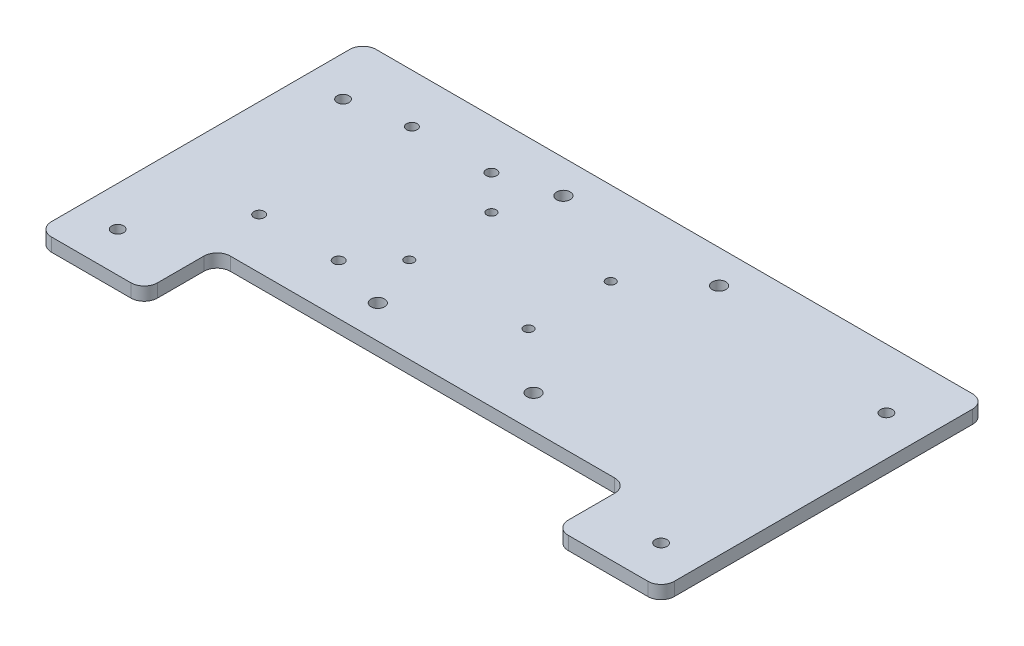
ISO-10303-21;
HEADER;
FILE_DESCRIPTION(('STEP AP214'),'2;1');
FILE_NAME('part.step','',(''),(''),'','','');
FILE_SCHEMA(('AUTOMOTIVE_DESIGN { 1 0 10303 214 1 1 1 1 }'));
ENDSEC;
DATA;
#1=APPLICATION_CONTEXT('core data for automotive mechanical design processes');
#2=APPLICATION_PROTOCOL_DEFINITION('international standard','automotive_design',2000,#1);
#3=PRODUCT_CONTEXT('',#1,'mechanical');
#4=PRODUCT('Part','Part','',(#3));
#5=PRODUCT_RELATED_PRODUCT_CATEGORY('part','',(#4));
#6=PRODUCT_DEFINITION_FORMATION('','',#4);
#7=PRODUCT_DEFINITION_CONTEXT('part definition',#1,'design');
#8=PRODUCT_DEFINITION('design','',#6,#7);
#9=PRODUCT_DEFINITION_SHAPE('','',#8);
#10=(LENGTH_UNIT() NAMED_UNIT(*) SI_UNIT(.MILLI.,.METRE.));
#11=(NAMED_UNIT(*) PLANE_ANGLE_UNIT() SI_UNIT($,.RADIAN.));
#12=(NAMED_UNIT(*) SI_UNIT($,.STERADIAN.) SOLID_ANGLE_UNIT());
#13=UNCERTAINTY_MEASURE_WITH_UNIT(LENGTH_MEASURE(1.E-05),#10,'distance_accuracy_value','');
#14=(GEOMETRIC_REPRESENTATION_CONTEXT(3) GLOBAL_UNCERTAINTY_ASSIGNED_CONTEXT((#13)) GLOBAL_UNIT_ASSIGNED_CONTEXT((#10,
#11,#12)) REPRESENTATION_CONTEXT('',''));
#15=CARTESIAN_POINT('',(0.,0.,0.));
#16=DIRECTION('',(0.,0.,1.));
#17=DIRECTION('',(1.,0.,0.));
#18=AXIS2_PLACEMENT_3D('',#15,#16,#17);
#19=CARTESIAN_POINT('',(145.,10.,-45.));
#20=DIRECTION('',(0.,1.,0.));
#21=DIRECTION('',(0.,0.,1.));
#22=AXIS2_PLACEMENT_3D('',#19,#20,#21);
#23=PLANE('',#22);
#24=CARTESIAN_POINT('',(-161.05,10.,-208.));
#25=DIRECTION('',(0.,1.,0.));
#26=DIRECTION('',(0.,0.,1.));
#27=AXIS2_PLACEMENT_3D('',#24,#25,#26);
#28=CIRCLE('',#27,3.99999999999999);
#29=CARTESIAN_POINT('',(-161.05,10.,-204.));
#30=VERTEX_POINT('',#29);
#31=EDGE_CURVE('E411',#30,#30,#28,.T.);
#32=ORIENTED_EDGE('',*,*,#31,.F.);
#33=EDGE_LOOP('',(#32));
#34=FACE_BOUND('',#33,.T.);
#35=CARTESIAN_POINT('',(-161.27839267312,10.,-93.0002267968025));
#36=DIRECTION('',(0.,1.,0.));
#37=DIRECTION('',(0.,0.,1.));
#38=AXIS2_PLACEMENT_3D('',#35,#36,#37);
#39=CIRCLE('',#38,3.99999999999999);
#40=CARTESIAN_POINT('',(-161.27839267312,10.,-89.0002267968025));
#41=VERTEX_POINT('',#40);
#42=EDGE_CURVE('E415',#41,#41,#39,.T.);
#43=ORIENTED_EDGE('',*,*,#42,.F.);
#44=EDGE_LOOP('',(#43));
#45=FACE_BOUND('',#44,.T.);
#46=CARTESIAN_POINT('',(-101.27839267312,10.,-93.0002267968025));
#47=DIRECTION('',(0.,1.,0.));
#48=DIRECTION('',(0.,0.,1.));
#49=AXIS2_PLACEMENT_3D('',#46,#47,#48);
#50=CIRCLE('',#49,4.00000000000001);
#51=CARTESIAN_POINT('',(-101.27839267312,10.,-89.0002267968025));
#52=VERTEX_POINT('',#51);
#53=EDGE_CURVE('E424',#52,#52,#50,.T.);
#54=ORIENTED_EDGE('',*,*,#53,.F.);
#55=EDGE_LOOP('',(#54));
#56=FACE_BOUND('',#55,.T.);
#57=CARTESIAN_POINT('',(-101.05,10.,-208.));
#58=DIRECTION('',(0.,1.,0.));
#59=DIRECTION('',(0.,0.,1.));
#60=AXIS2_PLACEMENT_3D('',#57,#58,#59);
#61=CIRCLE('',#60,4.00000000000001);
#62=CARTESIAN_POINT('',(-101.05,10.,-204.));
#63=VERTEX_POINT('',#62);
#64=EDGE_CURVE('E430',#63,#63,#61,.T.);
#65=ORIENTED_EDGE('',*,*,#64,.F.);
#66=EDGE_LOOP('',(#65));
#67=FACE_BOUND('',#66,.T.);
#68=CARTESIAN_POINT('',(58.75,10.,-220.));
#69=DIRECTION('',(0.,1.,0.));
#70=DIRECTION('',(0.,0.,1.));
#71=AXIS2_PLACEMENT_3D('',#68,#69,#70);
#72=CIRCLE('',#71,5.12500000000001);
#73=CARTESIAN_POINT('',(58.75,10.,-214.875));
#74=VERTEX_POINT('',#73);
#75=EDGE_CURVE('E436',#74,#74,#72,.T.);
#76=ORIENTED_EDGE('',*,*,#75,.F.);
#77=EDGE_LOOP('',(#76));
#78=FACE_BOUND('',#77,.T.);
#79=CARTESIAN_POINT('',(-58.75,10.,-220.));
#80=DIRECTION('',(0.,1.,0.));
#81=DIRECTION('',(0.,0.,1.));
#82=AXIS2_PLACEMENT_3D('',#79,#80,#81);
#83=CIRCLE('',#82,5.12500000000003);
#84=CARTESIAN_POINT('',(-58.75,10.,-214.875));
#85=VERTEX_POINT('',#84);
#86=EDGE_CURVE('E442',#85,#85,#83,.T.);
#87=ORIENTED_EDGE('',*,*,#86,.F.);
#88=EDGE_LOOP('',(#87));
#89=FACE_BOUND('',#88,.T.);
#90=CARTESIAN_POINT('',(58.75,10.,-80.));
#91=DIRECTION('',(0.,1.,0.));
#92=DIRECTION('',(0.,0.,1.));
#93=AXIS2_PLACEMENT_3D('',#90,#91,#92);
#94=CIRCLE('',#93,5.12500000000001);
#95=CARTESIAN_POINT('',(58.75,10.,-74.875));
#96=VERTEX_POINT('',#95);
#97=EDGE_CURVE('E448',#96,#96,#94,.T.);
#98=ORIENTED_EDGE('',*,*,#97,.F.);
#99=EDGE_LOOP('',(#98));
#100=FACE_BOUND('',#99,.T.);
#101=CARTESIAN_POINT('',(-58.75,10.,-80.));
#102=DIRECTION('',(0.,1.,0.));
#103=DIRECTION('',(0.,0.,1.));
#104=AXIS2_PLACEMENT_3D('',#101,#102,#103);
#105=CIRCLE('',#104,5.125);
#106=CARTESIAN_POINT('',(-58.75,10.,-74.875));
#107=VERTEX_POINT('',#106);
#108=EDGE_CURVE('E454',#107,#107,#105,.T.);
#109=ORIENTED_EDGE('',*,*,#108,.F.);
#110=EDGE_LOOP('',(#109));
#111=FACE_BOUND('',#110,.T.);
#112=CARTESIAN_POINT('',(15.,10.,-182.));
#113=DIRECTION('',(0.,1.,0.));
#114=DIRECTION('',(0.,0.,1.));
#115=AXIS2_PLACEMENT_3D('',#112,#113,#114);
#116=CIRCLE('',#115,3.5);
#117=CARTESIAN_POINT('',(15.,10.,-178.5));
#118=VERTEX_POINT('',#117);
#119=EDGE_CURVE('E469',#118,#118,#116,.T.);
#120=ORIENTED_EDGE('',*,*,#119,.F.);
#121=EDGE_LOOP('',(#120));
#122=FACE_BOUND('',#121,.T.);
#123=CARTESIAN_POINT('',(-75.,10.,-182.));
#124=DIRECTION('',(0.,1.,0.));
#125=DIRECTION('',(0.,0.,1.));
#126=AXIS2_PLACEMENT_3D('',#123,#124,#125);
#127=CIRCLE('',#126,3.50000000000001);
#128=CARTESIAN_POINT('',(-75.,10.,-178.5));
#129=VERTEX_POINT('',#128);
#130=EDGE_CURVE('E481',#129,#129,#127,.T.);
#131=ORIENTED_EDGE('',*,*,#130,.F.);
#132=EDGE_LOOP('',(#131));
#133=FACE_BOUND('',#132,.T.);
#134=CARTESIAN_POINT('',(-205.,10.,-30.));
#135=DIRECTION('',(0.,1.,0.));
#136=DIRECTION('',(0.,0.,-1.));
#137=AXIS2_PLACEMENT_3D('',#134,#135,#136);
#138=CIRCLE('',#137,4.49999999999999);
#139=CARTESIAN_POINT('',(-205.,10.,-34.5));
#140=VERTEX_POINT('',#139);
#141=EDGE_CURVE('E493',#140,#140,#138,.T.);
#142=ORIENTED_EDGE('',*,*,#141,.F.);
#143=EDGE_LOOP('',(#142));
#144=FACE_BOUND('',#143,.T.);
#145=CARTESIAN_POINT('',(205.,10.,-200.));
#146=DIRECTION('',(0.,1.,0.));
#147=DIRECTION('',(0.,0.,1.));
#148=AXIS2_PLACEMENT_3D('',#145,#146,#147);
#149=CIRCLE('',#148,4.49999999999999);
#150=CARTESIAN_POINT('',(205.,10.,-195.5));
#151=VERTEX_POINT('',#150);
#152=EDGE_CURVE('E161',#151,#151,#149,.T.);
#153=ORIENTED_EDGE('',*,*,#152,.F.);
#154=EDGE_LOOP('',(#153));
#155=FACE_BOUND('',#154,.T.);
#156=CARTESIAN_POINT('',(145.,10.,-45.));
#157=DIRECTION('',(0.,-1.,0.));
#158=DIRECTION('',(0.,0.,1.));
#159=AXIS2_PLACEMENT_3D('',#156,#157,#158);
#160=CIRCLE('',#159,10.);
#161=CARTESIAN_POINT('',(145.,10.,-55.));
#162=VERTEX_POINT('',#161);
#163=CARTESIAN_POINT('',(155.,10.,-44.9999999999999));
#164=VERTEX_POINT('',#163);
#165=EDGE_CURVE('E195',#162,#164,#160,.T.);
#166=ORIENTED_EDGE('',*,*,#165,.T.);
#167=DIRECTION('',(0.,0.,1.));
#168=VECTOR('',#167,1.);
#169=CARTESIAN_POINT('',(155.,10.,-44.9999999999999));
#170=LINE('',#169,#168);
#171=CARTESIAN_POINT('',(155.,10.,-10.0000000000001));
#172=VERTEX_POINT('',#171);
#173=EDGE_CURVE('E156',#164,#172,#170,.T.);
#174=ORIENTED_EDGE('',*,*,#173,.T.);
#175=CARTESIAN_POINT('',(165.,10.,-10.));
#176=DIRECTION('',(0.,1.,0.));
#177=DIRECTION('',(0.,0.,-1.));
#178=AXIS2_PLACEMENT_3D('',#175,#176,#177);
#179=CIRCLE('',#178,10.);
#180=CARTESIAN_POINT('',(165.,10.,0.));
#181=VERTEX_POINT('',#180);
#182=EDGE_CURVE('E198',#172,#181,#179,.T.);
#183=ORIENTED_EDGE('',*,*,#182,.T.);
#184=DIRECTION('',(1.,0.,0.));
#185=VECTOR('',#184,1.);
#186=CARTESIAN_POINT('',(165.,10.,0.));
#187=LINE('',#186,#185);
#188=CARTESIAN_POINT('',(225.,10.,0.));
#189=VERTEX_POINT('',#188);
#190=EDGE_CURVE('E200',#181,#189,#187,.T.);
#191=ORIENTED_EDGE('',*,*,#190,.T.);
#192=CARTESIAN_POINT('',(225.,10.,-10.));
#193=DIRECTION('',(0.,1.,0.));
#194=DIRECTION('',(0.,0.,-1.));
#195=AXIS2_PLACEMENT_3D('',#192,#193,#194);
#196=CIRCLE('',#195,10.);
#197=CARTESIAN_POINT('',(235.,10.,-10.0000000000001));
#198=VERTEX_POINT('',#197);
#199=EDGE_CURVE('E202',#189,#198,#196,.T.);
#200=ORIENTED_EDGE('',*,*,#199,.T.);
#201=DIRECTION('',(0.,0.,-1.));
#202=VECTOR('',#201,1.);
#203=CARTESIAN_POINT('',(235.,10.,-10.0000000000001));
#204=LINE('',#203,#202);
#205=CARTESIAN_POINT('',(235.,10.,-235.));
#206=VERTEX_POINT('',#205);
#207=EDGE_CURVE('E204',#198,#206,#204,.T.);
#208=ORIENTED_EDGE('',*,*,#207,.T.);
#209=CARTESIAN_POINT('',(225.,10.,-235.));
#210=DIRECTION('',(0.,1.,0.));
#211=DIRECTION('',(0.,0.,-1.));
#212=AXIS2_PLACEMENT_3D('',#209,#210,#211);
#213=CIRCLE('',#212,10.);
#214=CARTESIAN_POINT('',(225.,10.,-245.));
#215=VERTEX_POINT('',#214);
#216=EDGE_CURVE('E206',#206,#215,#213,.T.);
#217=ORIENTED_EDGE('',*,*,#216,.T.);
#218=DIRECTION('',(-1.,0.,0.));
#219=VECTOR('',#218,1.);
#220=CARTESIAN_POINT('',(-225.,10.,-245.));
#221=LINE('',#220,#219);
#222=CARTESIAN_POINT('',(-225.,10.,-245.));
#223=VERTEX_POINT('',#222);
#224=EDGE_CURVE('E208',#215,#223,#221,.T.);
#225=ORIENTED_EDGE('',*,*,#224,.T.);
#226=CARTESIAN_POINT('',(-225.,10.,-235.));
#227=DIRECTION('',(0.,1.,0.));
#228=DIRECTION('',(0.,0.,1.));
#229=AXIS2_PLACEMENT_3D('',#226,#227,#228);
#230=CIRCLE('',#229,10.);
#231=CARTESIAN_POINT('',(-235.,10.,-235.));
#232=VERTEX_POINT('',#231);
#233=EDGE_CURVE('E210',#223,#232,#230,.T.);
#234=ORIENTED_EDGE('',*,*,#233,.T.);
#235=DIRECTION('',(0.,0.,1.));
#236=VECTOR('',#235,1.);
#237=CARTESIAN_POINT('',(-235.,10.,-10.0000000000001));
#238=LINE('',#237,#236);
#239=CARTESIAN_POINT('',(-235.,10.,-10.0000000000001));
#240=VERTEX_POINT('',#239);
#241=EDGE_CURVE('E212',#232,#240,#238,.T.);
#242=ORIENTED_EDGE('',*,*,#241,.T.);
#243=CARTESIAN_POINT('',(-225.,10.,-10.));
#244=DIRECTION('',(0.,1.,0.));
#245=DIRECTION('',(0.,0.,1.));
#246=AXIS2_PLACEMENT_3D('',#243,#244,#245);
#247=CIRCLE('',#246,10.);
#248=CARTESIAN_POINT('',(-225.,10.,0.));
#249=VERTEX_POINT('',#248);
#250=EDGE_CURVE('E214',#240,#249,#247,.T.);
#251=ORIENTED_EDGE('',*,*,#250,.T.);
#252=DIRECTION('',(1.,0.,0.));
#253=VECTOR('',#252,1.);
#254=CARTESIAN_POINT('',(-165.,10.,0.));
#255=LINE('',#254,#253);
#256=CARTESIAN_POINT('',(-165.,10.,0.));
#257=VERTEX_POINT('',#256);
#258=EDGE_CURVE('E216',#249,#257,#255,.T.);
#259=ORIENTED_EDGE('',*,*,#258,.T.);
#260=CARTESIAN_POINT('',(-165.,10.,-10.));
#261=DIRECTION('',(0.,1.,0.));
#262=DIRECTION('',(0.,0.,1.));
#263=AXIS2_PLACEMENT_3D('',#260,#261,#262);
#264=CIRCLE('',#263,10.);
#265=CARTESIAN_POINT('',(-155.,10.,-10.0000000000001));
#266=VERTEX_POINT('',#265);
#267=EDGE_CURVE('E218',#257,#266,#264,.T.);
#268=ORIENTED_EDGE('',*,*,#267,.T.);
#269=DIRECTION('',(0.,0.,-1.));
#270=VECTOR('',#269,1.);
#271=CARTESIAN_POINT('',(-155.,10.,-44.9999999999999));
#272=LINE('',#271,#270);
#273=CARTESIAN_POINT('',(-155.,10.,-44.9999999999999));
#274=VERTEX_POINT('',#273);
#275=EDGE_CURVE('E220',#266,#274,#272,.T.);
#276=ORIENTED_EDGE('',*,*,#275,.T.);
#277=CARTESIAN_POINT('',(-145.,10.,-45.));
#278=DIRECTION('',(0.,-1.,0.));
#279=DIRECTION('',(0.,0.,-1.));
#280=AXIS2_PLACEMENT_3D('',#277,#278,#279);
#281=CIRCLE('',#280,10.);
#282=CARTESIAN_POINT('',(-145.,10.,-55.));
#283=VERTEX_POINT('',#282);
#284=EDGE_CURVE('E49',#274,#283,#281,.T.);
#285=ORIENTED_EDGE('',*,*,#284,.T.);
#286=DIRECTION('',(1.,0.,0.));
#287=VECTOR('',#286,1.);
#288=CARTESIAN_POINT('',(-145.,10.,-55.));
#289=LINE('',#288,#287);
#290=EDGE_CURVE('E44',#283,#162,#289,.T.);
#291=ORIENTED_EDGE('',*,*,#290,.T.);
#292=EDGE_LOOP('',(#166,#174,#183,#191,#200,#208,#217,#225,#234,#242,#251,#259,#268,#276,#285,#291));
#293=FACE_BOUND('',#292,.T.);
#294=CARTESIAN_POINT('',(205.,10.,-30.));
#295=DIRECTION('',(0.,1.,0.));
#296=DIRECTION('',(0.,0.,1.));
#297=AXIS2_PLACEMENT_3D('',#294,#295,#296);
#298=CIRCLE('',#297,4.49999999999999);
#299=CARTESIAN_POINT('',(205.,10.,-25.5));
#300=VERTEX_POINT('',#299);
#301=EDGE_CURVE('E499',#300,#300,#298,.T.);
#302=ORIENTED_EDGE('',*,*,#301,.F.);
#303=EDGE_LOOP('',(#302));
#304=FACE_BOUND('',#303,.T.);
#305=CARTESIAN_POINT('',(-205.,10.,-200.));
#306=DIRECTION('',(0.,1.,0.));
#307=DIRECTION('',(0.,0.,-1.));
#308=AXIS2_PLACEMENT_3D('',#305,#306,#307);
#309=CIRCLE('',#308,4.49999999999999);
#310=CARTESIAN_POINT('',(-205.,10.,-204.5));
#311=VERTEX_POINT('',#310);
#312=EDGE_CURVE('E487',#311,#311,#309,.T.);
#313=ORIENTED_EDGE('',*,*,#312,.F.);
#314=EDGE_LOOP('',(#313));
#315=FACE_BOUND('',#314,.T.);
#316=CARTESIAN_POINT('',(-75.,10.,-120.));
#317=DIRECTION('',(0.,1.,0.));
#318=DIRECTION('',(0.,0.,1.));
#319=AXIS2_PLACEMENT_3D('',#316,#317,#318);
#320=CIRCLE('',#319,3.50000000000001);
#321=CARTESIAN_POINT('',(-75.,10.,-116.5));
#322=VERTEX_POINT('',#321);
#323=EDGE_CURVE('E475',#322,#322,#320,.T.);
#324=ORIENTED_EDGE('',*,*,#323,.F.);
#325=EDGE_LOOP('',(#324));
#326=FACE_BOUND('',#325,.T.);
#327=CARTESIAN_POINT('',(15.,10.,-120.));
#328=DIRECTION('',(0.,1.,0.));
#329=DIRECTION('',(0.,0.,1.));
#330=AXIS2_PLACEMENT_3D('',#327,#328,#329);
#331=CIRCLE('',#330,3.5);
#332=CARTESIAN_POINT('',(15.,10.,-116.5));
#333=VERTEX_POINT('',#332);
#334=EDGE_CURVE('E463',#333,#333,#331,.T.);
#335=ORIENTED_EDGE('',*,*,#334,.F.);
#336=EDGE_LOOP('',(#335));
#337=FACE_BOUND('',#336,.T.);
#338=ADVANCED_FACE('F29',(#34,#45,#56,#67,#78,#89,#100,#111,#122,#133,#144,#155,#293,#304,#315,
#326,#337),#23,.T.);
#339=CARTESIAN_POINT('',(145.,0.,-45.));
#340=DIRECTION('',(0.,1.,0.));
#341=DIRECTION('',(0.,0.,1.));
#342=AXIS2_PLACEMENT_3D('',#339,#340,#341);
#343=PLANE('',#342);
#344=CARTESIAN_POINT('',(-161.05,0.,-208.));
#345=DIRECTION('',(0.,1.,0.));
#346=DIRECTION('',(0.,0.,1.));
#347=AXIS2_PLACEMENT_3D('',#344,#345,#346);
#348=CIRCLE('',#347,3.99999999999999);
#349=CARTESIAN_POINT('',(-161.05,0.,-204.));
#350=VERTEX_POINT('',#349);
#351=EDGE_CURVE('E414',#350,#350,#348,.F.);
#352=ORIENTED_EDGE('',*,*,#351,.F.);
#353=EDGE_LOOP('',(#352));
#354=FACE_BOUND('',#353,.T.);
#355=CARTESIAN_POINT('',(-161.27839267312,0.,-93.0002267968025));
#356=DIRECTION('',(0.,1.,0.));
#357=DIRECTION('',(0.,0.,1.));
#358=AXIS2_PLACEMENT_3D('',#355,#356,#357);
#359=CIRCLE('',#358,3.99999999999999);
#360=CARTESIAN_POINT('',(-161.27839267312,0.,-89.0002267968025));
#361=VERTEX_POINT('',#360);
#362=EDGE_CURVE('E418',#361,#361,#359,.F.);
#363=ORIENTED_EDGE('',*,*,#362,.F.);
#364=EDGE_LOOP('',(#363));
#365=FACE_BOUND('',#364,.T.);
#366=CARTESIAN_POINT('',(-101.27839267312,0.,-93.0002267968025));
#367=DIRECTION('',(0.,1.,0.));
#368=DIRECTION('',(0.,0.,1.));
#369=AXIS2_PLACEMENT_3D('',#366,#367,#368);
#370=CIRCLE('',#369,4.00000000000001);
#371=CARTESIAN_POINT('',(-101.27839267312,0.,-89.0002267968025));
#372=VERTEX_POINT('',#371);
#373=EDGE_CURVE('E427',#372,#372,#370,.F.);
#374=ORIENTED_EDGE('',*,*,#373,.F.);
#375=EDGE_LOOP('',(#374));
#376=FACE_BOUND('',#375,.T.);
#377=CARTESIAN_POINT('',(-101.05,0.,-208.));
#378=DIRECTION('',(0.,1.,0.));
#379=DIRECTION('',(0.,0.,1.));
#380=AXIS2_PLACEMENT_3D('',#377,#378,#379);
#381=CIRCLE('',#380,4.00000000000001);
#382=CARTESIAN_POINT('',(-101.05,0.,-204.));
#383=VERTEX_POINT('',#382);
#384=EDGE_CURVE('E433',#383,#383,#381,.F.);
#385=ORIENTED_EDGE('',*,*,#384,.F.);
#386=EDGE_LOOP('',(#385));
#387=FACE_BOUND('',#386,.T.);
#388=CARTESIAN_POINT('',(58.75,0.,-220.));
#389=DIRECTION('',(0.,1.,0.));
#390=DIRECTION('',(0.,0.,1.));
#391=AXIS2_PLACEMENT_3D('',#388,#389,#390);
#392=CIRCLE('',#391,5.12500000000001);
#393=CARTESIAN_POINT('',(58.75,0.,-214.875));
#394=VERTEX_POINT('',#393);
#395=EDGE_CURVE('E439',#394,#394,#392,.T.);
#396=ORIENTED_EDGE('',*,*,#395,.T.);
#397=EDGE_LOOP('',(#396));
#398=FACE_BOUND('',#397,.T.);
#399=CARTESIAN_POINT('',(-58.75,0.,-220.));
#400=DIRECTION('',(0.,1.,0.));
#401=DIRECTION('',(0.,0.,1.));
#402=AXIS2_PLACEMENT_3D('',#399,#400,#401);
#403=CIRCLE('',#402,5.12500000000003);
#404=CARTESIAN_POINT('',(-58.75,0.,-214.875));
#405=VERTEX_POINT('',#404);
#406=EDGE_CURVE('E445',#405,#405,#403,.T.);
#407=ORIENTED_EDGE('',*,*,#406,.T.);
#408=EDGE_LOOP('',(#407));
#409=FACE_BOUND('',#408,.T.);
#410=CARTESIAN_POINT('',(58.75,0.,-80.));
#411=DIRECTION('',(0.,1.,0.));
#412=DIRECTION('',(0.,0.,1.));
#413=AXIS2_PLACEMENT_3D('',#410,#411,#412);
#414=CIRCLE('',#413,5.12500000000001);
#415=CARTESIAN_POINT('',(58.75,0.,-74.875));
#416=VERTEX_POINT('',#415);
#417=EDGE_CURVE('E451',#416,#416,#414,.T.);
#418=ORIENTED_EDGE('',*,*,#417,.T.);
#419=EDGE_LOOP('',(#418));
#420=FACE_BOUND('',#419,.T.);
#421=CARTESIAN_POINT('',(-58.75,0.,-80.));
#422=DIRECTION('',(0.,1.,0.));
#423=DIRECTION('',(0.,0.,1.));
#424=AXIS2_PLACEMENT_3D('',#421,#422,#423);
#425=CIRCLE('',#424,5.125);
#426=CARTESIAN_POINT('',(-58.75,0.,-74.875));
#427=VERTEX_POINT('',#426);
#428=EDGE_CURVE('E457',#427,#427,#425,.T.);
#429=ORIENTED_EDGE('',*,*,#428,.T.);
#430=EDGE_LOOP('',(#429));
#431=FACE_BOUND('',#430,.T.);
#432=CARTESIAN_POINT('',(15.,0.,-182.));
#433=DIRECTION('',(0.,1.,0.));
#434=DIRECTION('',(0.,0.,1.));
#435=AXIS2_PLACEMENT_3D('',#432,#433,#434);
#436=CIRCLE('',#435,3.5);
#437=CARTESIAN_POINT('',(15.,0.,-178.5));
#438=VERTEX_POINT('',#437);
#439=EDGE_CURVE('E466',#438,#438,#436,.T.);
#440=ORIENTED_EDGE('',*,*,#439,.T.);
#441=EDGE_LOOP('',(#440));
#442=FACE_BOUND('',#441,.T.);
#443=CARTESIAN_POINT('',(-75.,0.,-182.));
#444=DIRECTION('',(0.,1.,0.));
#445=DIRECTION('',(0.,0.,1.));
#446=AXIS2_PLACEMENT_3D('',#443,#444,#445);
#447=CIRCLE('',#446,3.50000000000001);
#448=CARTESIAN_POINT('',(-75.,0.,-178.5));
#449=VERTEX_POINT('',#448);
#450=EDGE_CURVE('E478',#449,#449,#447,.T.);
#451=ORIENTED_EDGE('',*,*,#450,.T.);
#452=EDGE_LOOP('',(#451));
#453=FACE_BOUND('',#452,.T.);
#454=CARTESIAN_POINT('',(-205.,0.,-30.));
#455=DIRECTION('',(0.,1.,0.));
#456=DIRECTION('',(0.,0.,-1.));
#457=AXIS2_PLACEMENT_3D('',#454,#455,#456);
#458=CIRCLE('',#457,4.49999999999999);
#459=CARTESIAN_POINT('',(-205.,0.,-34.5));
#460=VERTEX_POINT('',#459);
#461=EDGE_CURVE('E490',#460,#460,#458,.T.);
#462=ORIENTED_EDGE('',*,*,#461,.T.);
#463=EDGE_LOOP('',(#462));
#464=FACE_BOUND('',#463,.T.);
#465=CARTESIAN_POINT('',(205.,0.,-200.));
#466=DIRECTION('',(0.,1.,0.));
#467=DIRECTION('',(0.,0.,1.));
#468=AXIS2_PLACEMENT_3D('',#465,#466,#467);
#469=CIRCLE('',#468,4.49999999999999);
#470=CARTESIAN_POINT('',(205.,0.,-195.5));
#471=VERTEX_POINT('',#470);
#472=EDGE_CURVE('E164',#471,#471,#469,.T.);
#473=ORIENTED_EDGE('',*,*,#472,.T.);
#474=EDGE_LOOP('',(#473));
#475=FACE_BOUND('',#474,.T.);
#476=CARTESIAN_POINT('',(145.,0.,-45.));
#477=DIRECTION('',(0.,-1.,0.));
#478=DIRECTION('',(0.,0.,1.));
#479=AXIS2_PLACEMENT_3D('',#476,#477,#478);
#480=CIRCLE('',#479,10.);
#481=CARTESIAN_POINT('',(145.,0.,-55.));
#482=VERTEX_POINT('',#481);
#483=CARTESIAN_POINT('',(155.,0.,-44.9999999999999));
#484=VERTEX_POINT('',#483);
#485=EDGE_CURVE('E147',#482,#484,#480,.T.);
#486=ORIENTED_EDGE('',*,*,#485,.F.);
#487=DIRECTION('',(1.,0.,0.));
#488=VECTOR('',#487,1.);
#489=CARTESIAN_POINT('',(-145.,0.,-55.));
#490=LINE('',#489,#488);
#491=CARTESIAN_POINT('',(-145.,0.,-55.));
#492=VERTEX_POINT('',#491);
#493=EDGE_CURVE('E193',#492,#482,#490,.T.);
#494=ORIENTED_EDGE('',*,*,#493,.F.);
#495=CARTESIAN_POINT('',(-145.,0.,-45.));
#496=DIRECTION('',(0.,-1.,0.));
#497=DIRECTION('',(0.,0.,-1.));
#498=AXIS2_PLACEMENT_3D('',#495,#496,#497);
#499=CIRCLE('',#498,10.);
#500=CARTESIAN_POINT('',(-155.,0.,-44.9999999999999));
#501=VERTEX_POINT('',#500);
#502=EDGE_CURVE('E191',#501,#492,#499,.T.);
#503=ORIENTED_EDGE('',*,*,#502,.F.);
#504=DIRECTION('',(0.,0.,-1.));
#505=VECTOR('',#504,1.);
#506=CARTESIAN_POINT('',(-155.,0.,-44.9999999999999));
#507=LINE('',#506,#505);
#508=CARTESIAN_POINT('',(-155.,0.,-10.0000000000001));
#509=VERTEX_POINT('',#508);
#510=EDGE_CURVE('E189',#509,#501,#507,.T.);
#511=ORIENTED_EDGE('',*,*,#510,.F.);
#512=CARTESIAN_POINT('',(-165.,0.,-10.));
#513=DIRECTION('',(0.,1.,0.));
#514=DIRECTION('',(0.,0.,1.));
#515=AXIS2_PLACEMENT_3D('',#512,#513,#514);
#516=CIRCLE('',#515,10.);
#517=CARTESIAN_POINT('',(-165.,0.,0.));
#518=VERTEX_POINT('',#517);
#519=EDGE_CURVE('E187',#518,#509,#516,.T.);
#520=ORIENTED_EDGE('',*,*,#519,.F.);
#521=DIRECTION('',(1.,0.,0.));
#522=VECTOR('',#521,1.);
#523=CARTESIAN_POINT('',(-165.,0.,0.));
#524=LINE('',#523,#522);
#525=CARTESIAN_POINT('',(-225.,0.,0.));
#526=VERTEX_POINT('',#525);
#527=EDGE_CURVE('E185',#526,#518,#524,.T.);
#528=ORIENTED_EDGE('',*,*,#527,.F.);
#529=CARTESIAN_POINT('',(-225.,0.,-10.));
#530=DIRECTION('',(0.,1.,0.));
#531=DIRECTION('',(0.,0.,1.));
#532=AXIS2_PLACEMENT_3D('',#529,#530,#531);
#533=CIRCLE('',#532,10.);
#534=CARTESIAN_POINT('',(-235.,0.,-10.0000000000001));
#535=VERTEX_POINT('',#534);
#536=EDGE_CURVE('E183',#535,#526,#533,.T.);
#537=ORIENTED_EDGE('',*,*,#536,.F.);
#538=DIRECTION('',(0.,0.,1.));
#539=VECTOR('',#538,1.);
#540=CARTESIAN_POINT('',(-235.,0.,-10.0000000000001));
#541=LINE('',#540,#539);
#542=CARTESIAN_POINT('',(-235.,0.,-235.));
#543=VERTEX_POINT('',#542);
#544=EDGE_CURVE('E181',#543,#535,#541,.T.);
#545=ORIENTED_EDGE('',*,*,#544,.F.);
#546=CARTESIAN_POINT('',(-225.,0.,-235.));
#547=DIRECTION('',(0.,1.,0.));
#548=DIRECTION('',(0.,0.,1.));
#549=AXIS2_PLACEMENT_3D('',#546,#547,#548);
#550=CIRCLE('',#549,10.);
#551=CARTESIAN_POINT('',(-225.,0.,-245.));
#552=VERTEX_POINT('',#551);
#553=EDGE_CURVE('E179',#552,#543,#550,.T.);
#554=ORIENTED_EDGE('',*,*,#553,.F.);
#555=DIRECTION('',(-1.,0.,0.));
#556=VECTOR('',#555,1.);
#557=CARTESIAN_POINT('',(-225.,0.,-245.));
#558=LINE('',#557,#556);
#559=CARTESIAN_POINT('',(225.,0.,-245.));
#560=VERTEX_POINT('',#559);
#561=EDGE_CURVE('E177',#560,#552,#558,.T.);
#562=ORIENTED_EDGE('',*,*,#561,.F.);
#563=CARTESIAN_POINT('',(225.,0.,-235.));
#564=DIRECTION('',(0.,1.,0.));
#565=DIRECTION('',(0.,0.,-1.));
#566=AXIS2_PLACEMENT_3D('',#563,#564,#565);
#567=CIRCLE('',#566,10.);
#568=CARTESIAN_POINT('',(235.,0.,-235.));
#569=VERTEX_POINT('',#568);
#570=EDGE_CURVE('E175',#569,#560,#567,.T.);
#571=ORIENTED_EDGE('',*,*,#570,.F.);
#572=DIRECTION('',(0.,0.,-1.));
#573=VECTOR('',#572,1.);
#574=CARTESIAN_POINT('',(235.,0.,-10.0000000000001));
#575=LINE('',#574,#573);
#576=CARTESIAN_POINT('',(235.,0.,-10.0000000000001));
#577=VERTEX_POINT('',#576);
#578=EDGE_CURVE('E173',#577,#569,#575,.T.);
#579=ORIENTED_EDGE('',*,*,#578,.F.);
#580=CARTESIAN_POINT('',(225.,0.,-10.));
#581=DIRECTION('',(0.,1.,0.));
#582=DIRECTION('',(0.,0.,-1.));
#583=AXIS2_PLACEMENT_3D('',#580,#581,#582);
#584=CIRCLE('',#583,10.);
#585=CARTESIAN_POINT('',(225.,0.,0.));
#586=VERTEX_POINT('',#585);
#587=EDGE_CURVE('E171',#586,#577,#584,.T.);
#588=ORIENTED_EDGE('',*,*,#587,.F.);
#589=DIRECTION('',(1.,0.,0.));
#590=VECTOR('',#589,1.);
#591=CARTESIAN_POINT('',(165.,0.,0.));
#592=LINE('',#591,#590);
#593=CARTESIAN_POINT('',(165.,0.,0.));
#594=VERTEX_POINT('',#593);
#595=EDGE_CURVE('E169',#594,#586,#592,.T.);
#596=ORIENTED_EDGE('',*,*,#595,.F.);
#597=CARTESIAN_POINT('',(165.,0.,-10.));
#598=DIRECTION('',(0.,1.,0.));
#599=DIRECTION('',(0.,0.,-1.));
#600=AXIS2_PLACEMENT_3D('',#597,#598,#599);
#601=CIRCLE('',#600,10.);
#602=CARTESIAN_POINT('',(155.,0.,-10.0000000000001));
#603=VERTEX_POINT('',#602);
#604=EDGE_CURVE('E149',#603,#594,#601,.T.);
#605=ORIENTED_EDGE('',*,*,#604,.F.);
#606=DIRECTION('',(0.,0.,1.));
#607=VECTOR('',#606,1.);
#608=CARTESIAN_POINT('',(155.,0.,-44.9999999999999));
#609=LINE('',#608,#607);
#610=EDGE_CURVE('E142',#484,#603,#609,.T.);
#611=ORIENTED_EDGE('',*,*,#610,.F.);
#612=EDGE_LOOP('',(#486,#494,#503,#511,#520,#528,#537,#545,#554,#562,#571,#579,#588,#596,#605,#611));
#613=FACE_BOUND('',#612,.T.);
#614=CARTESIAN_POINT('',(205.,0.,-30.));
#615=DIRECTION('',(0.,1.,0.));
#616=DIRECTION('',(0.,0.,1.));
#617=AXIS2_PLACEMENT_3D('',#614,#615,#616);
#618=CIRCLE('',#617,4.49999999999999);
#619=CARTESIAN_POINT('',(205.,0.,-25.5));
#620=VERTEX_POINT('',#619);
#621=EDGE_CURVE('E496',#620,#620,#618,.T.);
#622=ORIENTED_EDGE('',*,*,#621,.T.);
#623=EDGE_LOOP('',(#622));
#624=FACE_BOUND('',#623,.T.);
#625=CARTESIAN_POINT('',(-205.,0.,-200.));
#626=DIRECTION('',(0.,1.,0.));
#627=DIRECTION('',(0.,0.,-1.));
#628=AXIS2_PLACEMENT_3D('',#625,#626,#627);
#629=CIRCLE('',#628,4.49999999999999);
#630=CARTESIAN_POINT('',(-205.,0.,-204.5));
#631=VERTEX_POINT('',#630);
#632=EDGE_CURVE('E484',#631,#631,#629,.T.);
#633=ORIENTED_EDGE('',*,*,#632,.T.);
#634=EDGE_LOOP('',(#633));
#635=FACE_BOUND('',#634,.T.);
#636=CARTESIAN_POINT('',(-75.,0.,-120.));
#637=DIRECTION('',(0.,1.,0.));
#638=DIRECTION('',(0.,0.,1.));
#639=AXIS2_PLACEMENT_3D('',#636,#637,#638);
#640=CIRCLE('',#639,3.50000000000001);
#641=CARTESIAN_POINT('',(-75.,0.,-116.5));
#642=VERTEX_POINT('',#641);
#643=EDGE_CURVE('E472',#642,#642,#640,.T.);
#644=ORIENTED_EDGE('',*,*,#643,.T.);
#645=EDGE_LOOP('',(#644));
#646=FACE_BOUND('',#645,.T.);
#647=CARTESIAN_POINT('',(15.,0.,-120.));
#648=DIRECTION('',(0.,1.,0.));
#649=DIRECTION('',(0.,0.,1.));
#650=AXIS2_PLACEMENT_3D('',#647,#648,#649);
#651=CIRCLE('',#650,3.5);
#652=CARTESIAN_POINT('',(15.,0.,-116.5));
#653=VERTEX_POINT('',#652);
#654=EDGE_CURVE('E460',#653,#653,#651,.T.);
#655=ORIENTED_EDGE('',*,*,#654,.T.);
#656=EDGE_LOOP('',(#655));
#657=FACE_BOUND('',#656,.T.);
#658=ADVANCED_FACE('F143',(#354,#365,#376,#387,#398,#409,#420,#431,#442,#453,#464,#475,#613,
#624,#635,#646,#657),#343,.F.);
#659=CARTESIAN_POINT('',(145.,10.,-45.));
#660=DIRECTION('',(0.,-1.,0.));
#661=DIRECTION('',(0.,0.,-1.));
#662=AXIS2_PLACEMENT_3D('',#659,#660,#661);
#663=CYLINDRICAL_SURFACE('',#662,10.);
#664=ORIENTED_EDGE('',*,*,#485,.T.);
#665=DIRECTION('',(0.,-1.,0.));
#666=VECTOR('',#665,1.);
#667=CARTESIAN_POINT('',(155.,10.,-44.9999999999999));
#668=LINE('',#667,#666);
#669=EDGE_CURVE('E11',#164,#484,#668,.T.);
#670=ORIENTED_EDGE('',*,*,#669,.F.);
#671=ORIENTED_EDGE('',*,*,#165,.F.);
#672=DIRECTION('',(0.,-1.,0.));
#673=VECTOR('',#672,1.);
#674=CARTESIAN_POINT('',(145.,10.,-55.));
#675=LINE('',#674,#673);
#676=EDGE_CURVE('E160',#162,#482,#675,.T.);
#677=ORIENTED_EDGE('',*,*,#676,.T.);
#678=EDGE_LOOP('',(#664,#670,#671,#677));
#679=FACE_BOUND('',#678,.T.);
#680=ADVANCED_FACE('F31',(#679),#663,.F.);
#681=CARTESIAN_POINT('',(155.,10.,-44.9999999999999));
#682=DIRECTION('',(1.,0.,0.));
#683=DIRECTION('',(0.,0.,-1.));
#684=AXIS2_PLACEMENT_3D('',#681,#682,#683);
#685=PLANE('',#684);
#686=ORIENTED_EDGE('',*,*,#610,.T.);
#687=DIRECTION('',(0.,-1.,0.));
#688=VECTOR('',#687,1.);
#689=CARTESIAN_POINT('',(155.,10.,-10.0000000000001));
#690=LINE('',#689,#688);
#691=EDGE_CURVE('E37',#172,#603,#690,.T.);
#692=ORIENTED_EDGE('',*,*,#691,.F.);
#693=ORIENTED_EDGE('',*,*,#173,.F.);
#694=ORIENTED_EDGE('',*,*,#669,.T.);
#695=EDGE_LOOP('',(#686,#692,#693,#694));
#696=FACE_BOUND('',#695,.T.);
#697=ADVANCED_FACE('F155',(#696),#685,.F.);
#698=CARTESIAN_POINT('',(165.,10.,-10.));
#699=DIRECTION('',(0.,-1.,0.));
#700=DIRECTION('',(0.,0.,-1.));
#701=AXIS2_PLACEMENT_3D('',#698,#699,#700);
#702=CYLINDRICAL_SURFACE('',#701,10.);
#703=ORIENTED_EDGE('',*,*,#604,.T.);
#704=DIRECTION('',(0.,-1.,0.));
#705=VECTOR('',#704,1.);
#706=CARTESIAN_POINT('',(165.,10.,0.));
#707=LINE('',#706,#705);
#708=EDGE_CURVE('E261',#181,#594,#707,.T.);
#709=ORIENTED_EDGE('',*,*,#708,.F.);
#710=ORIENTED_EDGE('',*,*,#182,.F.);
#711=ORIENTED_EDGE('',*,*,#691,.T.);
#712=EDGE_LOOP('',(#703,#709,#710,#711));
#713=FACE_BOUND('',#712,.T.);
#714=ADVANCED_FACE('F265',(#713),#702,.T.);
#715=CARTESIAN_POINT('',(165.,10.,0.));
#716=DIRECTION('',(0.,0.,-1.));
#717=DIRECTION('',(-1.,0.,0.));
#718=AXIS2_PLACEMENT_3D('',#715,#716,#717);
#719=PLANE('',#718);
#720=ORIENTED_EDGE('',*,*,#595,.T.);
#721=DIRECTION('',(0.,-1.,0.));
#722=VECTOR('',#721,1.);
#723=CARTESIAN_POINT('',(225.,10.,0.));
#724=LINE('',#723,#722);
#725=EDGE_CURVE('E258',#189,#586,#724,.T.);
#726=ORIENTED_EDGE('',*,*,#725,.F.);
#727=ORIENTED_EDGE('',*,*,#190,.F.);
#728=ORIENTED_EDGE('',*,*,#708,.T.);
#729=EDGE_LOOP('',(#720,#726,#727,#728));
#730=FACE_BOUND('',#729,.T.);
#731=ADVANCED_FACE('F273',(#730),#719,.F.);
#732=CARTESIAN_POINT('',(225.,10.,-10.));
#733=DIRECTION('',(0.,-1.,0.));
#734=DIRECTION('',(0.,0.,-1.));
#735=AXIS2_PLACEMENT_3D('',#732,#733,#734);
#736=CYLINDRICAL_SURFACE('',#735,10.);
#737=ORIENTED_EDGE('',*,*,#587,.T.);
#738=DIRECTION('',(0.,-1.,0.));
#739=VECTOR('',#738,1.);
#740=CARTESIAN_POINT('',(235.,10.,-10.0000000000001));
#741=LINE('',#740,#739);
#742=EDGE_CURVE('E255',#198,#577,#741,.T.);
#743=ORIENTED_EDGE('',*,*,#742,.F.);
#744=ORIENTED_EDGE('',*,*,#199,.F.);
#745=ORIENTED_EDGE('',*,*,#725,.T.);
#746=EDGE_LOOP('',(#737,#743,#744,#745));
#747=FACE_BOUND('',#746,.T.);
#748=ADVANCED_FACE('F276',(#747),#736,.T.);
#749=CARTESIAN_POINT('',(235.,10.,-10.0000000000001));
#750=DIRECTION('',(-1.,0.,0.));
#751=DIRECTION('',(0.,0.,1.));
#752=AXIS2_PLACEMENT_3D('',#749,#750,#751);
#753=PLANE('',#752);
#754=ORIENTED_EDGE('',*,*,#578,.T.);
#755=DIRECTION('',(0.,-1.,0.));
#756=VECTOR('',#755,1.);
#757=CARTESIAN_POINT('',(235.,10.,-235.));
#758=LINE('',#757,#756);
#759=EDGE_CURVE('E252',#206,#569,#758,.T.);
#760=ORIENTED_EDGE('',*,*,#759,.F.);
#761=ORIENTED_EDGE('',*,*,#207,.F.);
#762=ORIENTED_EDGE('',*,*,#742,.T.);
#763=EDGE_LOOP('',(#754,#760,#761,#762));
#764=FACE_BOUND('',#763,.T.);
#765=ADVANCED_FACE('F281',(#764),#753,.F.);
#766=CARTESIAN_POINT('',(225.,10.,-235.));
#767=DIRECTION('',(0.,-1.,0.));
#768=DIRECTION('',(0.,0.,-1.));
#769=AXIS2_PLACEMENT_3D('',#766,#767,#768);
#770=CYLINDRICAL_SURFACE('',#769,10.);
#771=ORIENTED_EDGE('',*,*,#570,.T.);
#772=DIRECTION('',(0.,-1.,0.));
#773=VECTOR('',#772,1.);
#774=CARTESIAN_POINT('',(225.,10.,-245.));
#775=LINE('',#774,#773);
#776=EDGE_CURVE('E249',#215,#560,#775,.T.);
#777=ORIENTED_EDGE('',*,*,#776,.F.);
#778=ORIENTED_EDGE('',*,*,#216,.F.);
#779=ORIENTED_EDGE('',*,*,#759,.T.);
#780=EDGE_LOOP('',(#771,#777,#778,#779));
#781=FACE_BOUND('',#780,.T.);
#782=ADVANCED_FACE('F287',(#781),#770,.T.);
#783=CARTESIAN_POINT('',(-225.,10.,-245.));
#784=DIRECTION('',(0.,0.,1.));
#785=DIRECTION('',(1.,0.,0.));
#786=AXIS2_PLACEMENT_3D('',#783,#784,#785);
#787=PLANE('',#786);
#788=ORIENTED_EDGE('',*,*,#561,.T.);
#789=DIRECTION('',(0.,-1.,0.));
#790=VECTOR('',#789,1.);
#791=CARTESIAN_POINT('',(-225.,10.,-245.));
#792=LINE('',#791,#790);
#793=EDGE_CURVE('E246',#223,#552,#792,.T.);
#794=ORIENTED_EDGE('',*,*,#793,.F.);
#795=ORIENTED_EDGE('',*,*,#224,.F.);
#796=ORIENTED_EDGE('',*,*,#776,.T.);
#797=EDGE_LOOP('',(#788,#794,#795,#796));
#798=FACE_BOUND('',#797,.T.);
#799=ADVANCED_FACE('F291',(#798),#787,.F.);
#800=CARTESIAN_POINT('',(-225.,10.,-235.));
#801=DIRECTION('',(0.,-1.,0.));
#802=DIRECTION('',(0.,0.,-1.));
#803=AXIS2_PLACEMENT_3D('',#800,#801,#802);
#804=CYLINDRICAL_SURFACE('',#803,10.);
#805=ORIENTED_EDGE('',*,*,#553,.T.);
#806=DIRECTION('',(0.,-1.,0.));
#807=VECTOR('',#806,1.);
#808=CARTESIAN_POINT('',(-235.,10.,-235.));
#809=LINE('',#808,#807);
#810=EDGE_CURVE('E243',#232,#543,#809,.T.);
#811=ORIENTED_EDGE('',*,*,#810,.F.);
#812=ORIENTED_EDGE('',*,*,#233,.F.);
#813=ORIENTED_EDGE('',*,*,#793,.T.);
#814=EDGE_LOOP('',(#805,#811,#812,#813));
#815=FACE_BOUND('',#814,.T.);
#816=ADVANCED_FACE('F296',(#815),#804,.T.);
#817=CARTESIAN_POINT('',(-235.,10.,-10.0000000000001));
#818=DIRECTION('',(1.,0.,0.));
#819=DIRECTION('',(0.,0.,-1.));
#820=AXIS2_PLACEMENT_3D('',#817,#818,#819);
#821=PLANE('',#820);
#822=ORIENTED_EDGE('',*,*,#544,.T.);
#823=DIRECTION('',(0.,-1.,0.));
#824=VECTOR('',#823,1.);
#825=CARTESIAN_POINT('',(-235.,10.,-10.0000000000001));
#826=LINE('',#825,#824);
#827=EDGE_CURVE('E240',#240,#535,#826,.T.);
#828=ORIENTED_EDGE('',*,*,#827,.F.);
#829=ORIENTED_EDGE('',*,*,#241,.F.);
#830=ORIENTED_EDGE('',*,*,#810,.T.);
#831=EDGE_LOOP('',(#822,#828,#829,#830));
#832=FACE_BOUND('',#831,.T.);
#833=ADVANCED_FACE('F302',(#832),#821,.F.);
#834=CARTESIAN_POINT('',(-225.,10.,-10.));
#835=DIRECTION('',(0.,-1.,0.));
#836=DIRECTION('',(0.,0.,-1.));
#837=AXIS2_PLACEMENT_3D('',#834,#835,#836);
#838=CYLINDRICAL_SURFACE('',#837,10.);
#839=ORIENTED_EDGE('',*,*,#536,.T.);
#840=DIRECTION('',(0.,-1.,0.));
#841=VECTOR('',#840,1.);
#842=CARTESIAN_POINT('',(-225.,10.,0.));
#843=LINE('',#842,#841);
#844=EDGE_CURVE('E237',#249,#526,#843,.T.);
#845=ORIENTED_EDGE('',*,*,#844,.F.);
#846=ORIENTED_EDGE('',*,*,#250,.F.);
#847=ORIENTED_EDGE('',*,*,#827,.T.);
#848=EDGE_LOOP('',(#839,#845,#846,#847));
#849=FACE_BOUND('',#848,.T.);
#850=ADVANCED_FACE('F306',(#849),#838,.T.);
#851=CARTESIAN_POINT('',(-165.,10.,0.));
#852=DIRECTION('',(0.,0.,-1.));
#853=DIRECTION('',(-1.,0.,0.));
#854=AXIS2_PLACEMENT_3D('',#851,#852,#853);
#855=PLANE('',#854);
#856=ORIENTED_EDGE('',*,*,#527,.T.);
#857=DIRECTION('',(0.,-1.,0.));
#858=VECTOR('',#857,1.);
#859=CARTESIAN_POINT('',(-165.,10.,0.));
#860=LINE('',#859,#858);
#861=EDGE_CURVE('E234',#257,#518,#860,.T.);
#862=ORIENTED_EDGE('',*,*,#861,.F.);
#863=ORIENTED_EDGE('',*,*,#258,.F.);
#864=ORIENTED_EDGE('',*,*,#844,.T.);
#865=EDGE_LOOP('',(#856,#862,#863,#864));
#866=FACE_BOUND('',#865,.T.);
#867=ADVANCED_FACE('F311',(#866),#855,.F.);
#868=CARTESIAN_POINT('',(-165.,10.,-10.));
#869=DIRECTION('',(0.,-1.,0.));
#870=DIRECTION('',(0.,0.,-1.));
#871=AXIS2_PLACEMENT_3D('',#868,#869,#870);
#872=CYLINDRICAL_SURFACE('',#871,10.);
#873=ORIENTED_EDGE('',*,*,#519,.T.);
#874=DIRECTION('',(0.,-1.,0.));
#875=VECTOR('',#874,1.);
#876=CARTESIAN_POINT('',(-155.,10.,-10.0000000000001));
#877=LINE('',#876,#875);
#878=EDGE_CURVE('E231',#266,#509,#877,.T.);
#879=ORIENTED_EDGE('',*,*,#878,.F.);
#880=ORIENTED_EDGE('',*,*,#267,.F.);
#881=ORIENTED_EDGE('',*,*,#861,.T.);
#882=EDGE_LOOP('',(#873,#879,#880,#881));
#883=FACE_BOUND('',#882,.T.);
#884=ADVANCED_FACE('F317',(#883),#872,.T.);
#885=CARTESIAN_POINT('',(-155.,10.,-44.9999999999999));
#886=DIRECTION('',(-1.,0.,0.));
#887=DIRECTION('',(0.,0.,1.));
#888=AXIS2_PLACEMENT_3D('',#885,#886,#887);
#889=PLANE('',#888);
#890=ORIENTED_EDGE('',*,*,#510,.T.);
#891=DIRECTION('',(0.,-1.,0.));
#892=VECTOR('',#891,1.);
#893=CARTESIAN_POINT('',(-155.,10.,-44.9999999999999));
#894=LINE('',#893,#892);
#895=EDGE_CURVE('E228',#274,#501,#894,.T.);
#896=ORIENTED_EDGE('',*,*,#895,.F.);
#897=ORIENTED_EDGE('',*,*,#275,.F.);
#898=ORIENTED_EDGE('',*,*,#878,.T.);
#899=EDGE_LOOP('',(#890,#896,#897,#898));
#900=FACE_BOUND('',#899,.T.);
#901=ADVANCED_FACE('F321',(#900),#889,.F.);
#902=CARTESIAN_POINT('',(-145.,10.,-45.));
#903=DIRECTION('',(0.,-1.,0.));
#904=DIRECTION('',(0.,0.,-1.));
#905=AXIS2_PLACEMENT_3D('',#902,#903,#904);
#906=CYLINDRICAL_SURFACE('',#905,10.);
#907=ORIENTED_EDGE('',*,*,#502,.T.);
#908=DIRECTION('',(0.,-1.,0.));
#909=VECTOR('',#908,1.);
#910=CARTESIAN_POINT('',(-145.,10.,-55.));
#911=LINE('',#910,#909);
#912=EDGE_CURVE('E225',#283,#492,#911,.T.);
#913=ORIENTED_EDGE('',*,*,#912,.F.);
#914=ORIENTED_EDGE('',*,*,#284,.F.);
#915=ORIENTED_EDGE('',*,*,#895,.T.);
#916=EDGE_LOOP('',(#907,#913,#914,#915));
#917=FACE_BOUND('',#916,.T.);
#918=ADVANCED_FACE('F324',(#917),#906,.F.);
#919=CARTESIAN_POINT('',(-145.,10.,-55.));
#920=DIRECTION('',(0.,0.,-1.));
#921=DIRECTION('',(-1.,0.,0.));
#922=AXIS2_PLACEMENT_3D('',#919,#920,#921);
#923=PLANE('',#922);
#924=ORIENTED_EDGE('',*,*,#493,.T.);
#925=ORIENTED_EDGE('',*,*,#676,.F.);
#926=ORIENTED_EDGE('',*,*,#290,.F.);
#927=ORIENTED_EDGE('',*,*,#912,.T.);
#928=EDGE_LOOP('',(#924,#925,#926,#927));
#929=FACE_BOUND('',#928,.T.);
#930=ADVANCED_FACE('F326',(#929),#923,.F.);
#931=CARTESIAN_POINT('',(205.,10.,-200.));
#932=DIRECTION('',(0.,-1.,0.));
#933=DIRECTION('',(0.,0.,-1.));
#934=AXIS2_PLACEMENT_3D('',#931,#932,#933);
#935=CYLINDRICAL_SURFACE('',#934,4.49999999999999);
#936=ORIENTED_EDGE('',*,*,#152,.T.);
#937=EDGE_LOOP('',(#936));
#938=FACE_BOUND('',#937,.T.);
#939=ORIENTED_EDGE('',*,*,#472,.F.);
#940=EDGE_LOOP('',(#939));
#941=FACE_BOUND('',#940,.T.);
#942=ADVANCED_FACE('F328',(#938,#941),#935,.F.);
#943=CARTESIAN_POINT('',(205.,10.,-30.));
#944=DIRECTION('',(0.,-1.,0.));
#945=DIRECTION('',(0.,0.,-1.));
#946=AXIS2_PLACEMENT_3D('',#943,#944,#945);
#947=CYLINDRICAL_SURFACE('',#946,4.49999999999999);
#948=ORIENTED_EDGE('',*,*,#301,.T.);
#949=EDGE_LOOP('',(#948));
#950=FACE_BOUND('',#949,.T.);
#951=ORIENTED_EDGE('',*,*,#621,.F.);
#952=EDGE_LOOP('',(#951));
#953=FACE_BOUND('',#952,.T.);
#954=ADVANCED_FACE('F334',(#950,#953),#947,.F.);
#955=CARTESIAN_POINT('',(-205.,10.,-30.));
#956=DIRECTION('',(0.,-1.,0.));
#957=DIRECTION('',(0.,0.,-1.));
#958=AXIS2_PLACEMENT_3D('',#955,#956,#957);
#959=CYLINDRICAL_SURFACE('',#958,4.49999999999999);
#960=ORIENTED_EDGE('',*,*,#141,.T.);
#961=EDGE_LOOP('',(#960));
#962=FACE_BOUND('',#961,.T.);
#963=ORIENTED_EDGE('',*,*,#461,.F.);
#964=EDGE_LOOP('',(#963));
#965=FACE_BOUND('',#964,.T.);
#966=ADVANCED_FACE('F352',(#962,#965),#959,.F.);
#967=CARTESIAN_POINT('',(-205.,10.,-200.));
#968=DIRECTION('',(0.,-1.,0.));
#969=DIRECTION('',(0.,0.,-1.));
#970=AXIS2_PLACEMENT_3D('',#967,#968,#969);
#971=CYLINDRICAL_SURFACE('',#970,4.49999999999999);
#972=ORIENTED_EDGE('',*,*,#312,.T.);
#973=EDGE_LOOP('',(#972));
#974=FACE_BOUND('',#973,.T.);
#975=ORIENTED_EDGE('',*,*,#632,.F.);
#976=EDGE_LOOP('',(#975));
#977=FACE_BOUND('',#976,.T.);
#978=ADVANCED_FACE('F356',(#974,#977),#971,.F.);
#979=CARTESIAN_POINT('',(-75.,10.,-182.));
#980=DIRECTION('',(0.,-1.,0.));
#981=DIRECTION('',(0.,0.,-1.));
#982=AXIS2_PLACEMENT_3D('',#979,#980,#981);
#983=CYLINDRICAL_SURFACE('',#982,3.50000000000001);
#984=ORIENTED_EDGE('',*,*,#130,.T.);
#985=EDGE_LOOP('',(#984));
#986=FACE_BOUND('',#985,.T.);
#987=ORIENTED_EDGE('',*,*,#450,.F.);
#988=EDGE_LOOP('',(#987));
#989=FACE_BOUND('',#988,.T.);
#990=ADVANCED_FACE('F360',(#986,#989),#983,.F.);
#991=CARTESIAN_POINT('',(-75.,10.,-120.));
#992=DIRECTION('',(0.,-1.,0.));
#993=DIRECTION('',(0.,0.,-1.));
#994=AXIS2_PLACEMENT_3D('',#991,#992,#993);
#995=CYLINDRICAL_SURFACE('',#994,3.50000000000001);
#996=ORIENTED_EDGE('',*,*,#323,.T.);
#997=EDGE_LOOP('',(#996));
#998=FACE_BOUND('',#997,.T.);
#999=ORIENTED_EDGE('',*,*,#643,.F.);
#1000=EDGE_LOOP('',(#999));
#1001=FACE_BOUND('',#1000,.T.);
#1002=ADVANCED_FACE('F364',(#998,#1001),#995,.F.);
#1003=CARTESIAN_POINT('',(15.,10.,-182.));
#1004=DIRECTION('',(0.,-1.,0.));
#1005=DIRECTION('',(0.,0.,-1.));
#1006=AXIS2_PLACEMENT_3D('',#1003,#1004,#1005);
#1007=CYLINDRICAL_SURFACE('',#1006,3.5);
#1008=ORIENTED_EDGE('',*,*,#119,.T.);
#1009=EDGE_LOOP('',(#1008));
#1010=FACE_BOUND('',#1009,.T.);
#1011=ORIENTED_EDGE('',*,*,#439,.F.);
#1012=EDGE_LOOP('',(#1011));
#1013=FACE_BOUND('',#1012,.T.);
#1014=ADVANCED_FACE('F368',(#1010,#1013),#1007,.F.);
#1015=CARTESIAN_POINT('',(15.,10.,-120.));
#1016=DIRECTION('',(0.,-1.,0.));
#1017=DIRECTION('',(0.,0.,-1.));
#1018=AXIS2_PLACEMENT_3D('',#1015,#1016,#1017);
#1019=CYLINDRICAL_SURFACE('',#1018,3.5);
#1020=ORIENTED_EDGE('',*,*,#334,.T.);
#1021=EDGE_LOOP('',(#1020));
#1022=FACE_BOUND('',#1021,.T.);
#1023=ORIENTED_EDGE('',*,*,#654,.F.);
#1024=EDGE_LOOP('',(#1023));
#1025=FACE_BOUND('',#1024,.T.);
#1026=ADVANCED_FACE('F372',(#1022,#1025),#1019,.F.);
#1027=CARTESIAN_POINT('',(-58.75,0.,-80.));
#1028=DIRECTION('',(0.,1.,0.));
#1029=DIRECTION('',(0.,0.,1.));
#1030=AXIS2_PLACEMENT_3D('',#1027,#1028,#1029);
#1031=CYLINDRICAL_SURFACE('',#1030,5.125);
#1032=ORIENTED_EDGE('',*,*,#428,.F.);
#1033=EDGE_LOOP('',(#1032));
#1034=FACE_BOUND('',#1033,.T.);
#1035=ORIENTED_EDGE('',*,*,#108,.T.);
#1036=EDGE_LOOP('',(#1035));
#1037=FACE_BOUND('',#1036,.T.);
#1038=ADVANCED_FACE('F376',(#1034,#1037),#1031,.F.);
#1039=CARTESIAN_POINT('',(58.75,0.,-80.));
#1040=DIRECTION('',(0.,1.,0.));
#1041=DIRECTION('',(0.,0.,1.));
#1042=AXIS2_PLACEMENT_3D('',#1039,#1040,#1041);
#1043=CYLINDRICAL_SURFACE('',#1042,5.12500000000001);
#1044=ORIENTED_EDGE('',*,*,#417,.F.);
#1045=EDGE_LOOP('',(#1044));
#1046=FACE_BOUND('',#1045,.T.);
#1047=ORIENTED_EDGE('',*,*,#97,.T.);
#1048=EDGE_LOOP('',(#1047));
#1049=FACE_BOUND('',#1048,.T.);
#1050=ADVANCED_FACE('F380',(#1046,#1049),#1043,.F.);
#1051=CARTESIAN_POINT('',(-58.75,0.,-220.));
#1052=DIRECTION('',(0.,1.,0.));
#1053=DIRECTION('',(0.,0.,1.));
#1054=AXIS2_PLACEMENT_3D('',#1051,#1052,#1053);
#1055=CYLINDRICAL_SURFACE('',#1054,5.12500000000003);
#1056=ORIENTED_EDGE('',*,*,#406,.F.);
#1057=EDGE_LOOP('',(#1056));
#1058=FACE_BOUND('',#1057,.T.);
#1059=ORIENTED_EDGE('',*,*,#86,.T.);
#1060=EDGE_LOOP('',(#1059));
#1061=FACE_BOUND('',#1060,.T.);
#1062=ADVANCED_FACE('F384',(#1058,#1061),#1055,.F.);
#1063=CARTESIAN_POINT('',(58.75,0.,-220.));
#1064=DIRECTION('',(0.,1.,0.));
#1065=DIRECTION('',(0.,0.,1.));
#1066=AXIS2_PLACEMENT_3D('',#1063,#1064,#1065);
#1067=CYLINDRICAL_SURFACE('',#1066,5.12500000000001);
#1068=ORIENTED_EDGE('',*,*,#395,.F.);
#1069=EDGE_LOOP('',(#1068));
#1070=FACE_BOUND('',#1069,.T.);
#1071=ORIENTED_EDGE('',*,*,#75,.T.);
#1072=EDGE_LOOP('',(#1071));
#1073=FACE_BOUND('',#1072,.T.);
#1074=ADVANCED_FACE('F388',(#1070,#1073),#1067,.F.);
#1075=CARTESIAN_POINT('',(-101.05,-0.000999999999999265,-208.));
#1076=DIRECTION('',(0.,1.,0.));
#1077=DIRECTION('',(0.,0.,1.));
#1078=AXIS2_PLACEMENT_3D('',#1075,#1076,#1077);
#1079=CYLINDRICAL_SURFACE('',#1078,4.00000000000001);
#1080=ORIENTED_EDGE('',*,*,#64,.T.);
#1081=EDGE_LOOP('',(#1080));
#1082=FACE_BOUND('',#1081,.T.);
#1083=ORIENTED_EDGE('',*,*,#384,.T.);
#1084=EDGE_LOOP('',(#1083));
#1085=FACE_BOUND('',#1084,.T.);
#1086=ADVANCED_FACE('F391',(#1082,#1085),#1079,.F.);
#1087=CARTESIAN_POINT('',(-101.27839267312,-0.000999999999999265,-93.0002267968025));
#1088=DIRECTION('',(0.,1.,0.));
#1089=DIRECTION('',(0.,0.,1.));
#1090=AXIS2_PLACEMENT_3D('',#1087,#1088,#1089);
#1091=CYLINDRICAL_SURFACE('',#1090,4.00000000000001);
#1092=ORIENTED_EDGE('',*,*,#53,.T.);
#1093=EDGE_LOOP('',(#1092));
#1094=FACE_BOUND('',#1093,.T.);
#1095=ORIENTED_EDGE('',*,*,#373,.T.);
#1096=EDGE_LOOP('',(#1095));
#1097=FACE_BOUND('',#1096,.T.);
#1098=ADVANCED_FACE('F395',(#1094,#1097),#1091,.F.);
#1099=CARTESIAN_POINT('',(-161.27839267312,-0.000999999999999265,-93.0002267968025));
#1100=DIRECTION('',(0.,1.,0.));
#1101=DIRECTION('',(0.,0.,1.));
#1102=AXIS2_PLACEMENT_3D('',#1099,#1100,#1101);
#1103=CYLINDRICAL_SURFACE('',#1102,3.99999999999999);
#1104=ORIENTED_EDGE('',*,*,#42,.T.);
#1105=EDGE_LOOP('',(#1104));
#1106=FACE_BOUND('',#1105,.T.);
#1107=ORIENTED_EDGE('',*,*,#362,.T.);
#1108=EDGE_LOOP('',(#1107));
#1109=FACE_BOUND('',#1108,.T.);
#1110=ADVANCED_FACE('F399',(#1106,#1109),#1103,.F.);
#1111=CARTESIAN_POINT('',(-161.05,-0.000999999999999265,-208.));
#1112=DIRECTION('',(0.,1.,0.));
#1113=DIRECTION('',(0.,0.,1.));
#1114=AXIS2_PLACEMENT_3D('',#1111,#1112,#1113);
#1115=CYLINDRICAL_SURFACE('',#1114,3.99999999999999);
#1116=ORIENTED_EDGE('',*,*,#31,.T.);
#1117=EDGE_LOOP('',(#1116));
#1118=FACE_BOUND('',#1117,.T.);
#1119=ORIENTED_EDGE('',*,*,#351,.T.);
#1120=EDGE_LOOP('',(#1119));
#1121=FACE_BOUND('',#1120,.T.);
#1122=ADVANCED_FACE('F403',(#1118,#1121),#1115,.F.);
#1123=CLOSED_SHELL('',(#338,#658,#680,#697,#714,#731,#748,#765,#782,#799,#816,#833,#850,#867,
#884,#901,#918,#930,#942,#954,#966,#978,#990,#1002,#1014,#1026,#1038,#1050,#1062,#1074,#1086,
#1098,#1110,#1122));
#1124=MANIFOLD_SOLID_BREP('B2',#1123);
#1125=ADVANCED_BREP_SHAPE_REPRESENTATION('',(#18,#1124),#14);
#1126=SHAPE_DEFINITION_REPRESENTATION(#9,#1125);
ENDSEC;
END-ISO-10303-21;
